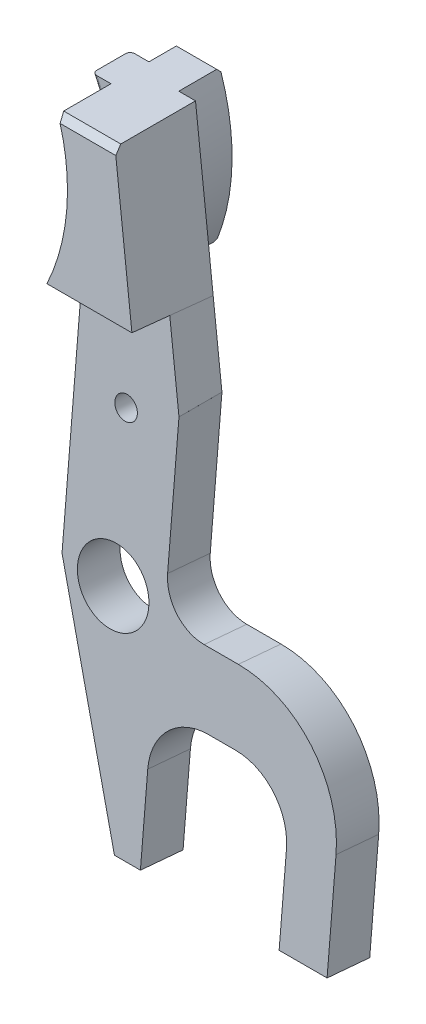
from build123d import *

# Parameters (mm, degrees)
EXTRUDE1_DEPTH        = 13.208
CUT_EXTRUDE5_DEPTH    = 29.464
CUT_EXTRUDE7_DEPTH    = 29.464
LPATTERN1_COUNT       = 3
LPATTERN1_PITCH       = 13.208
EXTRUDE6_DEPTH        = 16.129
FILLET1_R             = 3.556
SKETCH15_W            = 12.3444
SKETCH15_H            = 12.446
CUT_EXTRUDE9_DEPTH    = 53.538184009
FILLET2_R             = 9.525
FILLET3_R             = 4.953
CUT_EXTRUDE10_DEPTH   = 55.053417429
EXTRUDE7_DEPTH        = 3.3782
FILLET5_R             = 0.381
SKETCH19_R            = 0.127
EXTRUDE8_DEPTH        = 3.81
CUT_EXTRUDE11_REACH   = 56.053
SKETCH21_W            = 13.877180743
SKETCH21_H            = 21.48680987
CUT_EXTRUDE12_DEPTH   = 1.0414
CUT_EXTRUDE13_DEPTH   = 53.396954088
CHAMFER2_SIZE         = 0.508
CHAMFER2_SIZE2        = 0.558831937
CUT_EXTRUDE15_DEPTH   = 45.597980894
CHAMFER3_SIZE         = 0.2794
CHAMFER3_EDGE_2_SIZE  = 0.2794
CHAMFER3_EDGE_3_SIZE  = 0.2794
CHAMFER3_EDGE_3_SIZE2 = 0.25790362
CUT_EXTRUDE16_DEPTH   = 0.00254
EXTRUDE10_DEPTH       = 0.00254
SKETCH36_R            = 3.17246
CUT_EXTRUDE17_DEPTH   = 53.798562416
CUT_EXTRUDE19_REACH   = 54.768


with BuildPart() as part:
    # Sketch1 → Extrude1 (new body)
    with BuildSketch(Plane.XY):
        with BuildLine():
            Line((23.513358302, 14.732), (23.513358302, -19.304))
            Line((23.513358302, -19.304), (14.369358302, -19.304))
            Line((14.369358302, -19.304), (14.369358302, 21.59))
            ThreePointArc((14.369358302, 21.59), (15.7099, 27.94), (14.369358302, 34.29))
            Line((14.369358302, 34.29), (19.449358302, 34.29))
            Line((19.449358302, 34.29), (23.513358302, 14.732))
        make_face()
    extrude(amount=EXTRUDE1_DEPTH)

    # Sketch2 → Cut-Extrude5 (cut)
    with BuildSketch(Plane(origin=(0, 0, 0), x_dir=(0, 0, -1), z_dir=(1, 0, 0))):
        Polygon((-6.104500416, 18.174524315), (-9.383446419, -19.304), (0, -19.304), (0, 17.640449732), align=None)
        Polygon((-9.900002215, 18.506587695), (-13.208, -19.304), (-13.208, 18.796), align=None)
    extrude(amount=CUT_EXTRUDE5_DEPTH, mode=Mode.SUBTRACT)

    # Sketch3 → Cut-Extrude7 (cut)
    with BuildSketch(Plane(origin=(0, 0, 0), x_dir=(0, 0, -1), z_dir=(1, 0, 0))):
        Polygon((-9.383446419, -19.304), (-13.178948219, -18.97193662), (-13.861110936, -26.769092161), (-10.065609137, -27.101155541), align=None)
    extrude(amount=CUT_EXTRUDE7_DEPTH, mode=Mode.SUBTRACT)

    # Sketch6 → M2x0.4 Tapped Hole1 (revolve, cut)
    with BuildSketch(Plane(origin=(18.941358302, 13.213799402, 10.363061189), x_dir=(0, -0.9961946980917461, 0.08715574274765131), z_dir=(1, 0, 0))):
        Polygon((0, 0), (0, 6.480168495), (0.8, 5.99948), (0.8, 4.0005), (1, 4.0005), (1, 0), align=None)
    m2x0_4_tapped_hole1 = revolve(axis=Axis((18.941358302, 13.767238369, 16.688897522), (0, -0.08715574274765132, -0.9961946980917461)), mode=Mode.SUBTRACT)

    # LPattern1: M2x0.4 Tapped Hole1 ×3, 1 skipped
    with Locations(*[Vector(0, -0.9961946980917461, 0.0871557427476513) * (i * LPATTERN1_PITCH) for i in range(1, LPATTERN1_COUNT) if i not in (2,)]):
        add(m2x0_4_tapped_hole1, mode=Mode.SUBTRACT)

    # Sketch14 → Extrude6 (add)
    with BuildSketch(Plane(origin=(23.513358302, 0, 0), x_dir=(0, 0, -1), z_dir=(1, 0, 0))):
        Polygon((-13.178948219, -18.97193662), (-9.383446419, -19.304), (-7.756335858, -0.706041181), (-11.551837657, -0.373977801), align=None)
    extrude(amount=EXTRUDE6_DEPTH)

    # Fillet1
    fillet1_edges = [part.edges().sort_by_distance(p)[0] for p in [
        (23.513358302, -0.540009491, 9.654086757),
    ]]
    fillet(fillet1_edges, radius=FILLET1_R)

    # Sketch15 → Cut-Extrude9 (cut, through all)
    with BuildSketch(Plane(origin=(0, 0.668073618, 7.63611639), x_dir=(-1, 0, 0), z_dir=(0, -0.08715574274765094, -0.9961946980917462))):
        with Locations((-29.202958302, -13.825363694)):
            Rectangle(SKETCH15_W, SKETCH15_H)
    extrude(amount=-CUT_EXTRUDE9_DEPTH, mode=Mode.SUBTRACT)

    # Fillet2
    fillet2_edges = [part.edges().sort_by_distance(p)[0] for p in [
        (39.642358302, -0.540009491, 9.654086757),
    ]]
    fillet(fillet2_edges, radius=FILLET2_R)

    # Fillet3
    fillet3_edges = [part.edges().sort_by_distance(p)[0] for p in [
        (23.030758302, -6.739329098, 10.196456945),
        (35.375158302, -6.739329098, 10.196456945),
    ]]
    fillet(fillet3_edges, radius=FILLET3_R)

    # Sketch16 → Cut-Extrude10 (cut, through all)
    with BuildSketch(Plane(origin=(0, 0, 0), x_dir=(0, 0, -1), z_dir=(1, 0, 0))):
        Polygon((-13.208, 18.796), (-11.852450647, 34.29), (-13.208, 34.29), align=None)
    extrude(amount=CUT_EXTRUDE10_DEPTH, mode=Mode.SUBTRACT)

    # Sketch18 → Extrude7 (add)
    with BuildSketch(Plane.XY.offset(3.7592)):
        with BuildLine():
            Line((14.369358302, 34.29), (12.699517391, 34.29))
            ThreePointArc((12.699517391, 34.29), (14.1986, 27.94), (12.699517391, 21.59))
            Line((12.699517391, 21.59), (14.369358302, 21.59))
            ThreePointArc((14.369358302, 21.59), (15.7099, 27.94), (14.369358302, 34.29))
        make_face()
    extrude(amount=EXTRUDE7_DEPTH)

    # Fillet5
    fillet5_edges = [part.edges().sort_by_distance(p)[0] for p in [
        (14.1986, 27.94, 3.7592),
        (14.1986, 27.94, 7.1374),
    ]]
    fillet(fillet5_edges, radius=FILLET5_R)

    # Sketch19 → Extrude8 (add)
    with BuildSketch(Plane(origin=(0, 1.000136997, 11.43161819), x_dir=(1, 0, 0), z_dir=(0, 0.08715574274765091, 0.9961946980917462))):
        with Locations((18.941358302, -14.155683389)):
            Circle(SKETCH19_R)
    extrude(amount=-EXTRUDE8_DEPTH)

    # Cut-Extrude11: up to this plane
    cut_extrude11_end = Plane(origin=(29.464, 18.174524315, 6.104500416), z_dir=(0, -0.08715574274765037, -0.9961946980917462))
    # Sketch20 → Cut-Extrude11 (cut, up to the surface)
    with BuildSketch(Plane(origin=(0, 0, 0), x_dir=(-1, 0, 0), z_dir=(0, 0, -1)), mode=Mode.PRIVATE) as cut_extrude11_sk1:
        with BuildLine():
            Line((-24.199568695, 17.640449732), (-16.025659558, 17.640449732))
            ThreePointArc((-16.025659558, 17.640449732), (-18.922654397, 25.740988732), (-17.960512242, 34.29))
            Line((-17.960512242, 34.29), (-24.199568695, 34.29))
            Line((-24.199568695, 34.29), (-24.199568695, 17.640449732))
        make_face()
    cut_extrude11_tool1 = split(extrude(cut_extrude11_sk1.sketch, amount=-CUT_EXTRUDE11_REACH, mode=Mode.PRIVATE), bisect_by=cut_extrude11_end, keep=Keep.BOTH, mode=Mode.PRIVATE)
    add(cut_extrude11_tool1.solids().sort_by_distance((21.202604, 25.529516, 0))[0], mode=Mode.SUBTRACT)

    # Sketch21 → Cut-Extrude12 (cut)
    with BuildSketch(Plane.XY):
        with Locations((16.730731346, 25.018678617)):
            Rectangle(SKETCH21_W, SKETCH21_H)
    extrude(amount=CUT_EXTRUDE12_DEPTH, mode=Mode.SUBTRACT)

    # Sketch23 → Cut-Extrude13 (cut, through all)
    with BuildSketch(Plane(origin=(0, 0.668073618, 7.63611639), x_dir=(-1, 0, 0), z_dir=(0, -0.08715574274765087, -0.9961946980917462))):
        Polygon((-14.369358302, -20.048363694), (-14.369358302, -0.711320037), (-20.719358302, -20.048363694), align=None)
    extrude(amount=-CUT_EXTRUDE13_DEPTH, mode=Mode.SUBTRACT)

    # Chamfer2
    chamfer2_edges = [part.edges().sort_by_distance(p)[0] for p in [
        (16.909358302, 34.29, 11.852450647),
    ]]
    chamfer2_side = [part.faces().sort_by_distance(p)[0] for p in [
        (16.391343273, 34.29, 6.699448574),
    ]]
    chamfer(chamfer2_edges, length=CHAMFER2_SIZE, length2=CHAMFER2_SIZE2, reference=chamfer2_side[0])

    # Sketch26 → Cut-Extrude15 (cut, through all)
    with BuildSketch(Plane.ZY.offset(-14.369358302)):
        Polygon((6.104500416, 18.174524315), (1.0414, 17.731560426), (1.0414, 20.791203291), (5.838849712, 21.210925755), align=None)
        Polygon((9.900002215, 18.506587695), (13.208, 18.796), (12.942349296, 21.83240144), (9.634351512, 21.542989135), align=None)
    extrude(amount=-CUT_EXTRUDE15_DEPTH, mode=Mode.SUBTRACT)

    # Chamfer3
    chamfer3_edges = [part.edges().sort_by_distance(p)[0] for p in [
        (15.7099, 27.94, 1.0414),
    ]]
    chamfer(chamfer3_edges, length=CHAMFER3_SIZE)

    # Chamfer3 edge 2
    chamfer3_edge_2_edges = [part.edges().sort_by_distance(p)[0] for p in [
        (16.164935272, 34.29, 1.0414),
    ]]
    chamfer(chamfer3_edge_2_edges, length=CHAMFER3_EDGE_2_SIZE)

    # Chamfer3 edge 3
    chamfer3_edge_3_edges = [part.edges().sort_by_distance(p)[0] for p in [
        (16.013569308, 20.791203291, 1.0414),
    ]]
    chamfer3_edge_3_side = [part.faces().sort_by_distance(p)[0] for p in [
        (16.055423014, 21.002767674, 3.459591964),
    ]]
    chamfer(chamfer3_edge_3_edges, length=CHAMFER3_EDGE_3_SIZE, length2=CHAMFER3_EDGE_3_SIZE2, reference=chamfer3_edge_3_side[0])

    # Sketch33 → Cut-Extrude16 (cut)
    with BuildSketch(Plane(origin=(25.474620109, 5.293427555, 0), x_dir=(0, 0, -1), z_dir=(0.9790860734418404, 0.20344645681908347, 0))):
        Polygon((-10.230235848, 9.640186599), (-9.634351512, 16.59666297), (-5.838849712, 16.257506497), (-6.405682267, 9.640186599), align=None)
    extrude(amount=-CUT_EXTRUDE16_DEPTH, mode=Mode.SUBTRACT)

    # Sketch35 → Extrude10 (add)
    with BuildSketch(Plane.ZY.offset(-14.369358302)):
        Polygon((10.171688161, 21.59), (1.319736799, 20.815554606), (1.080333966, 21.016437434), (1.3208, 21.59), align=None)
    extrude(amount=EXTRUDE10_DEPTH)

    # Sketch36 → Cut-Extrude17 (cut, through all)
    with BuildSketch(Plane(origin=(0, 1.000136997, 11.43161819), x_dir=(1, 0, 0), z_dir=(0, 0.08715574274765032, 0.9961946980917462))):
        with Locations(Location((18.941358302, -0.947683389, 0), (0, 0, 270))):
            Circle(SKETCH36_R)
    extrude(amount=-CUT_EXTRUDE17_DEPTH, mode=Mode.SUBTRACT)

    # Sketch38 → Cut-Extrude19 (cut, up to next)
    with BuildSketch(Plane.XY.offset(7.1374), mode=Mode.PRIVATE) as cut_extrude19_sk1:
        Polygon((14.369358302, 21.59), (12.699517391, 23.259840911), (12.699517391, 21.59), align=None)
    cut_extrude19_tool1 = extrude(cut_extrude19_sk1.sketch, amount=-CUT_EXTRUDE19_REACH, mode=Mode.PRIVATE) & part.part
    add(cut_extrude19_tool1.solids().sort_by_distance((13.256131, 22.146614, 7.1374))[0], mode=Mode.SUBTRACT)


solid = part.part
